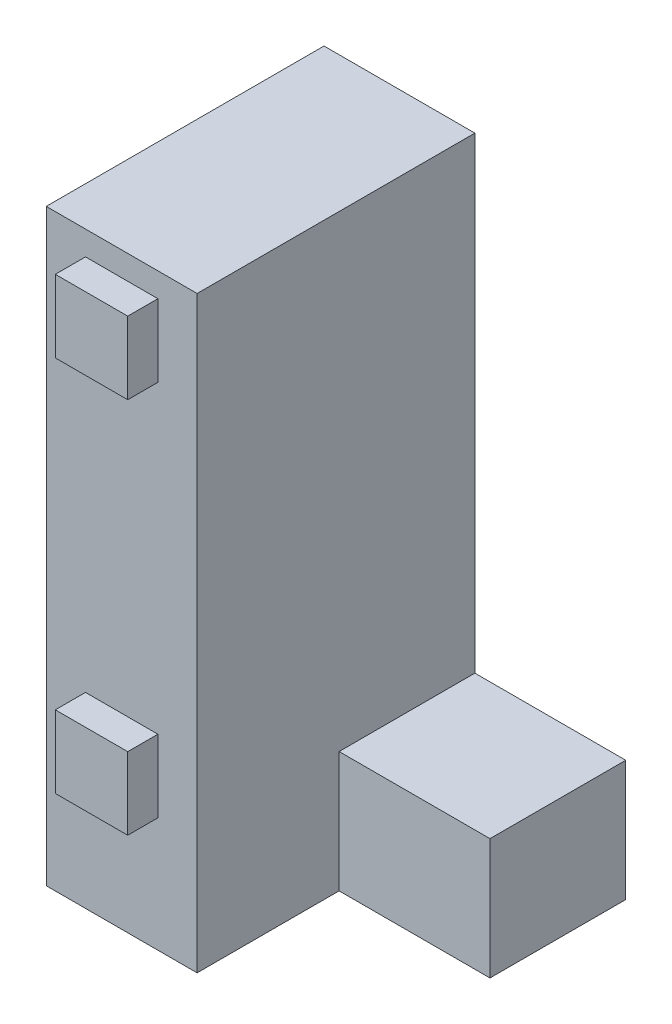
from build123d import *

# Parameters (mm, degrees)
SKETCH1_W                = 50
SKETCH1_H                = 150
BOSS_EXTRUDE1_DEPTH      = 250
SKETCH2_R                = 52.5
CUT_EXTRUDE1_DEPTH       = 15
BOSS_EXTRUDE2_DEPTH      = 150
BOSS_EXTRUDE3_DEPTH      = 175
SKETCH10_W               = 49.988184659
SKETCH10_H               = 250
BOSS_EXTRUDE4_DEPTH      = 200
CUT_EXTRUDE4_DEPTH       = 471.132959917
SKETCH12_W               = 200
SKETCH12_H               = 49.988184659
CUT_EXTRUDE5_DEPTH       = 55
CUT_EXTRUDE8_DEPTH       = 20
SKETCH17_W               = 12.5
SKETCH17_H               = 10.5
CUT_EXTRUDE9_DEPTH       = 9
SKETCH20_R               = 54.5
CUT_EXTRUDE10_DEPTH      = 10
SKETCH21_W               = 182.056865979
SKETCH21_H               = 55
CUT_EXTRUDE11_DEPTH      = 457.207189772
SKETCH24_W               = 16.5
SKETCH24_H               = 16.5
CUT_EXTRUDE13_DEPTH      = 50
SKETCH25_W               = 16.5
SKETCH25_H               = 22
CUT_EXTRUDE14_DEPTH      = 50
SKETCH26_W               = 16.5
SKETCH26_H               = 6.313729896
CUT_EXTRUDE15_DEPTH      = 50
CUT_EXTRUDE16_START      = -71.75
CUT_EXTRUDE16_DEPTH      = 29
SKETCH29_W               = 12.5
SKETCH29_H               = 10.5
CUT_EXTRUDE18_DEPTH      = 9
SKETCH30_W               = 40.672773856
SKETCH30_H               = 32.854304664
CUT_EXTRUDE19_DEPTH      = 50
SKETCH31_R               = 3.5
CUT_EXTRUDE20_DEPTH      = 20
CUT_EXTRUDE21_DEPTH      = 33
SKETCH33_R               = 63
SKETCH33_R_2             = 60
CUT_EXTRUDE22_DEPTH      = 20
SKETCH34_W               = 321
SKETCH34_H               = 90
CUT_EXTRUDE23_DEPTH      = 300
CUT_EXTRUDE24_DEPTH      = 358.678093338
CUT_EXTRUDE24_DEPTH_BACK = 358.678093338
SKETCH35_W               = 71
SKETCH35_H               = 235
SKETCH35_W_2             = 71.037708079
BOSS_EXTRUDE5_START      = -155
SKETCH36_W               = 50
SKETCH36_H               = 45
BOSS_EXTRUDE5_DEPTH      = 40
SKETCH38_W               = 110
SKETCH38_H               = 15
BOSS_EXTRUDE6_DEPTH      = 40
SKETCH39_W               = 110
SKETCH39_H               = 15
BOSS_EXTRUDE7_DEPTH      = 40
CUT_EXTRUDE25_DEPTH      = 342.833292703
CUT_EXTRUDE25_DEPTH_BACK = 342.833292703
SKETCH40_R               = 5
SKETCH41_W               = 20.15
SKETCH41_H               = 20.15
CUT_EXTRUDE26_DEPTH      = 31.5
CUT_EXTRUDE27_DEPTH      = 43
CUT_EXTRUDE27_DEPTH_BACK = 114
SKETCH42_W               = 142.943134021
SKETCH42_H               = 250
SKETCH43_W               = 24
SKETCH43_H               = 24
BOSS_EXTRUDE8_DEPTH      = 10
SKETCH44_W               = 24
SKETCH44_H               = 24
BOSS_EXTRUDE9_DEPTH      = 10


with BuildPart() as part:
    # Sketch1 → Boss-Extrude1 (new body)
    with BuildSketch(Plane(origin=(0, 0, 0), x_dir=(1, 0, 0), z_dir=(0, 1, 0))):
        with Locations((5, 75)):
            Rectangle(SKETCH1_W, SKETCH1_H)
    extrude(amount=BOSS_EXTRUDE1_DEPTH)

    # Sketch2 → Cut-Extrude1 (cut)
    with BuildSketch(Plane(origin=(30, 0, 0), x_dir=(0, 0, -1), z_dir=(1, 0, 0))):
        with Locations((75, 175)):
            Circle(SKETCH2_R)
    extrude(amount=-CUT_EXTRUDE1_DEPTH, mode=Mode.SUBTRACT)

    # Sketch4 → Boss-Extrude2 (add)
    with BuildSketch(Plane.XY):
        with BuildLine():
            Line((30, 0), (30, 62.5))
            ThreePointArc((30, 62.5), (53.728602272, 17.849160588), (101.037708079, 0))
            Line((101.037708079, 0), (30, 0))
        make_face()
        with BuildLine():
            Line((-20, 0), (-91, 0))
            ThreePointArc((-91, 0), (-43.705047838, 17.850934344), (-20, 62.5))
            Line((-20, 62.5), (-20, 0))
        make_face()
    extrude(amount=-BOSS_EXTRUDE2_DEPTH)

    # Sketch8 → Boss-Extrude3 (add)
    with BuildSketch(Plane(origin=(0, 0, -150), x_dir=(-1, 0, 0), z_dir=(0, 0, -1))):
        with BuildLine():
            Line((-30, 250), (-30, 62.5))
            ThreePointArc((-30, 62.5), (-53.728602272, 17.849160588), (-101.037708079, 0))
            Line((-101.037708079, 0), (91, 0))
            ThreePointArc((91, 0), (43.705047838, 17.850934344), (20, 62.5))
            Line((20, 62.5), (20, 250))
            Line((20, 250), (-30, 250))
        make_face()
    extrude(amount=BOSS_EXTRUDE3_DEPTH)

    # Sketch10 → Boss-Extrude4 (add)
    with BuildSketch(Plane(origin=(30, 0, 0), x_dir=(0, 0, -1), z_dir=(1, 0, 0))):
        with Locations((300.005907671, 125)):
            Rectangle(SKETCH10_W, SKETCH10_H)
    extrude(amount=BOSS_EXTRUDE4_DEPTH)

    # Sketch11 → Cut-Extrude4 (cut, through all)
    with BuildSketch(Plane(origin=(0, 0, -325), x_dir=(-1, 0, 0), z_dir=(0, 0, -1))):
        Polygon((-166.5, 175), (-135.5, 175), (-135.5, 154), (-197.5, 154), (-197.5, 175), align=None)
    extrude(amount=-CUT_EXTRUDE4_DEPTH, mode=Mode.SUBTRACT)

    # Sketch12 → Cut-Extrude5 (cut)
    with BuildSketch(Plane(origin=(0, 250, 0), x_dir=(1, 0, 0), z_dir=(0, 1, 0))):
        with Locations((130, 300.005907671)):
            Rectangle(SKETCH12_W, SKETCH12_H)
    extrude(amount=-CUT_EXTRUDE5_DEPTH, mode=Mode.SUBTRACT)

    # Sketch16 → Cut-Extrude8 (cut)
    with BuildSketch(Plane(origin=(15, 0, 0), x_dir=(0, 0, -1), z_dir=(1, 0, 0))):
        with BuildLine():
            Line((71.75, 180), (78.25, 180))
            add(Edge.make_bspline(
                [(78.25, 170), (84.285140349, 175), (78.25, 180)],
                knots=[0, 0, 0, 1, 1, 1], degree=2))
            Line((78.25, 170), (71.75, 170))
            add(Edge.make_bspline(
                [(71.75, 180), (66.057994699, 175), (71.75, 170)],
                knots=[0, 0, 0, 1, 1, 1], degree=2))
        make_face()
    extrude(amount=-CUT_EXTRUDE8_DEPTH, mode=Mode.SUBTRACT)

    # Sketch17 → Cut-Extrude9 (cut)
    with BuildSketch(Plane(origin=(15, 0, 0), x_dir=(0, 0, -1), z_dir=(1, 0, 0))):
        with Locations((75.068297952, 175)):
            Rectangle(SKETCH17_W, SKETCH17_H)
    extrude(amount=-CUT_EXTRUDE9_DEPTH, mode=Mode.SUBTRACT)

    # Sketch20 → Cut-Extrude10 (cut)
    with BuildSketch(Plane(origin=(30, 0, 0), x_dir=(0, 0, -1), z_dir=(1, 0, 0))):
        with Locations((75, 175)):
            Circle(SKETCH20_R)
    extrude(amount=-CUT_EXTRUDE10_DEPTH, mode=Mode.SUBTRACT)

    # Sketch21 → Cut-Extrude11 (cut, through all)
    with BuildSketch(Plane(origin=(30, 0, 0), x_dir=(0, 0, -1), z_dir=(1, 0, 0))):
        with Locations((233.97156701, 222.5)):
            Rectangle(SKETCH21_W, SKETCH21_H)
    extrude(amount=-CUT_EXTRUDE11_DEPTH, mode=Mode.SUBTRACT)

    # Sketch24 → Cut-Extrude13 (cut)
    with BuildSketch(Plane.XY.offset(-275.011815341)):
        with Locations((166.5, 145.75)):
            Rectangle(SKETCH24_W, SKETCH24_H)
    extrude(amount=-CUT_EXTRUDE13_DEPTH, mode=Mode.SUBTRACT)

    # Sketch25 → Cut-Extrude14 (cut)
    with BuildSketch(Plane.XY.offset(-275.011815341)):
        with Locations((166.5, 120.186270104)):
            Rectangle(SKETCH25_W, SKETCH25_H)
    extrude(amount=-CUT_EXTRUDE14_DEPTH, mode=Mode.SUBTRACT)

    # Sketch26 → Cut-Extrude15 (cut)
    with BuildSketch(Plane.XY.offset(-275.011815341)):
        with Locations((166.5, 134.343135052)):
            Rectangle(SKETCH26_W, SKETCH26_H)
    extrude(amount=-CUT_EXTRUDE15_DEPTH, mode=Mode.SUBTRACT)

    # Sketch27 → Cut-Extrude16 (cut)
    with BuildSketch(Plane(origin=(230, 0, 0), x_dir=(0, 0, -1), z_dir=(1, 0, 0)).offset(CUT_EXTRUDE16_START)):
        with BuildLine():
            Line((291.501152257, 135.100374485), (298.001152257, 135.100374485))
            add(Edge.make_bspline(
                [(298.001152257, 125.100374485), (303.344461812, 130.207776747), (298.001152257, 135.100374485)],
                knots=[0, 0, 0, 1, 1, 1], degree=2))
            Line((298.001152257, 125.100374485), (291.501152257, 125.100374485))
            add(Edge.make_bspline(
                [(291.501152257, 135.100374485), (285.456075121, 130.207776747), (291.501152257, 125.100374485)],
                knots=[0, 0, 0, 1, 1, 1], degree=2))
        make_face()
    extrude(amount=-CUT_EXTRUDE16_DEPTH, mode=Mode.SUBTRACT)

    # Sketch29 → Cut-Extrude18 (cut)
    with BuildSketch(Plane(origin=(158.25, 0, 0), x_dir=(0, 0, -1), z_dir=(1, 0, 0))):
        with Locations((294.582313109, 130.149892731)):
            Rectangle(SKETCH29_W, SKETCH29_H)
        with BuildLine():
            Line((298.001152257, 135.100374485), (291.501152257, 135.100374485))
            add(Edge.make_bspline(
                [(291.501152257, 135.100374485), (285.456075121, 130.207776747), (291.501152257, 125.100374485)],
                knots=[0, 0, 0, 1, 1, 1], degree=2))
            Line((291.501152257, 125.100374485), (298.001152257, 125.100374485))
            add(Edge.make_bspline(
                [(298.001152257, 125.100374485), (303.344461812, 130.207776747), (298.001152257, 135.100374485)],
                knots=[0, 0, 0, 1, 1, 1], degree=2))
        make_face(mode=Mode.SUBTRACT)
    extrude(amount=-CUT_EXTRUDE18_DEPTH, mode=Mode.SUBTRACT)

    # Sketch30 → Cut-Extrude19 (cut)
    with BuildSketch(Plane.XY.offset(-275.011815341)):
        with Locations((178.586386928, 125.602490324)):
            Rectangle(SKETCH30_W, SKETCH30_H)
    extrude(amount=-CUT_EXTRUDE19_DEPTH, mode=Mode.SUBTRACT)

    # Sketch31 → Cut-Extrude20 (cut)
    with BuildSketch(Plane(origin=(-5, 0, 0), x_dir=(0, 0, -1), z_dir=(1, 0, 0))):
        with Locations((74.950457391, 175.071160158)):
            Circle(SKETCH31_R)
    extrude(amount=-CUT_EXTRUDE20_DEPTH, mode=Mode.SUBTRACT)

    # Sketch32 → Cut-Extrude21 (cut)
    with BuildSketch(Plane(origin=(0, 0, -325), x_dir=(-1, 0, 0), z_dir=(0, 0, -1))):
        with BuildLine():
            ThreePointArc((-128.116356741, 129.990231), (-128.41227742, 131.398732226), (-129.25, 132.569059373))
            Line((-129.25, 132.569059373), (-129.25, 127.411402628))
            ThreePointArc((-129.25, 127.411402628), (-128.41227742, 128.581729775), (-128.116356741, 129.990231))
        make_face()
        with BuildLine():
            Line((-129.25, 127.411402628), (-129.25, 132.569059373))
            ThreePointArc((-129.25, 132.569059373), (-135.116356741, 129.990231), (-129.25, 127.411402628))
        make_face()
    extrude(amount=-CUT_EXTRUDE21_DEPTH, mode=Mode.SUBTRACT)

    # Sketch33 → Cut-Extrude22 (cut)
    with BuildSketch(Plane(origin=(30, 0, 0), x_dir=(0, 0, -1), z_dir=(1, 0, 0))):
        with Locations((74.950457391, 175.071160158)):
            Circle(SKETCH33_R)
        with Locations((74.950457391, 175.071160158)):
            Circle(SKETCH33_R_2, mode=Mode.SUBTRACT)
    extrude(amount=-CUT_EXTRUDE22_DEPTH, mode=Mode.SUBTRACT)

    # Sketch34 → Cut-Extrude23 (cut)
    with BuildSketch(Plane(origin=(0, 195, 0), x_dir=(1, 0, 0), z_dir=(0, 1, 0))):
        with Locations((69.5, 280)):
            Rectangle(SKETCH34_W, SKETCH34_H)
    extrude(amount=-CUT_EXTRUDE23_DEPTH, mode=Mode.SUBTRACT)

    # Sketch35 → Cut-Extrude24 (cut, two sides: drawn at the far end of the back side and taken through both)
    with BuildSketch(Plane(origin=(0, 250, 0), x_dir=(1, 0, 0), z_dir=(0, 1, 0)).offset(-CUT_EXTRUDE24_DEPTH_BACK)):
        with Locations((-55.5, 117.5)):
            Rectangle(SKETCH35_W, SKETCH35_H)
        with Locations((65.51885404, 117.5)):
            Rectangle(SKETCH35_W_2, SKETCH35_H)
    extrude(amount=CUT_EXTRUDE24_DEPTH + CUT_EXTRUDE24_DEPTH_BACK, mode=Mode.SUBTRACT)

    # Sketch36 → Boss-Extrude5 (add)
    with BuildSketch(Plane(origin=(0, 195, 0), x_dir=(1, 0, 0), z_dir=(0, 1, 0)).offset(BOSS_EXTRUDE5_START)):
        with Locations((55, 212.5)):
            Rectangle(SKETCH36_W, SKETCH36_H)
    extrude(amount=-BOSS_EXTRUDE5_DEPTH)

    # Sketch38 → Boss-Extrude6 (add)
    with BuildSketch(Plane(origin=(30, 0, 0), x_dir=(0, 0, -1), z_dir=(1, 0, 0))):
        with Locations((55, 7.5)):
            Rectangle(SKETCH38_W, SKETCH38_H)
    extrude(amount=BOSS_EXTRUDE6_DEPTH)

    # Sketch39 → Boss-Extrude7 (add)
    with BuildSketch(Plane.ZY.offset(20)):
        with Locations((-55, 7.5)):
            Rectangle(SKETCH39_W, SKETCH39_H)
    extrude(amount=BOSS_EXTRUDE7_DEPTH)

    # Sketch40 → Cut-Extrude25 (cut, two sides: drawn at the far end of the back side and taken through both)
    with BuildSketch(Plane(origin=(0, 15, 0), x_dir=(1, 0, 0), z_dir=(0, 1, 0)).offset(-CUT_EXTRUDE25_DEPTH_BACK)):
        with Locations(Location((-40, 85, 0), (0, 0, 270))):
            Circle(SKETCH40_R)
        with Locations(Location((-40, 25, 0), (0, 0, 270))):
            Circle(SKETCH40_R)
        with Locations(Location((50, 85, 0), (0, 0, 270))):
            Circle(SKETCH40_R)
        with Locations(Location((50, 25, 0), (0, 0, 270))):
            Circle(SKETCH40_R)
    extrude(amount=CUT_EXTRUDE25_DEPTH + CUT_EXTRUDE25_DEPTH_BACK, mode=Mode.SUBTRACT)

    # Sketch41 → Cut-Extrude26 (cut)
    with BuildSketch(Plane(origin=(0, 0, -235), x_dir=(-1, 0, 0), z_dir=(0, 0, -1))):
        with Locations((-5, 152)):
            Rectangle(SKETCH41_W, SKETCH41_H)
        with Locations((-5, 99)):
            Rectangle(SKETCH41_W, SKETCH41_H)
        with Locations((-5, 46)):
            Rectangle(SKETCH41_W, SKETCH41_H)
        with Locations((-52, 20)):
            Rectangle(SKETCH41_W, SKETCH41_H)
    extrude(amount=-CUT_EXTRUDE26_DEPTH, mode=Mode.SUBTRACT)

    # Sketch42 → Cut-Extrude27 (cut, two sides: drawn at the far end of the back side and taken through both)
    with BuildSketch(Plane(origin=(30, 0, 0), x_dir=(0, 0, -1), z_dir=(1, 0, 0)).offset(-CUT_EXTRUDE27_DEPTH_BACK)):
        with Locations((71.471567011, 125)):
            Rectangle(SKETCH42_W, SKETCH42_H)
    extrude(amount=CUT_EXTRUDE27_DEPTH + CUT_EXTRUDE27_DEPTH_BACK, mode=Mode.SUBTRACT)

    # Sketch43 → Boss-Extrude8 (add)
    with BuildSketch(Plane.XY.offset(-142.943134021)):
        with Locations((5, 50)):
            Rectangle(SKETCH43_W, SKETCH43_H)
    extrude(amount=BOSS_EXTRUDE8_DEPTH)

    # Sketch44 → Boss-Extrude9 (add)
    with BuildSketch(Plane.XY.offset(-142.943134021)):
        with Locations((5, 175)):
            Rectangle(SKETCH44_W, SKETCH44_H)
    extrude(amount=BOSS_EXTRUDE9_DEPTH)


solid = part.part
